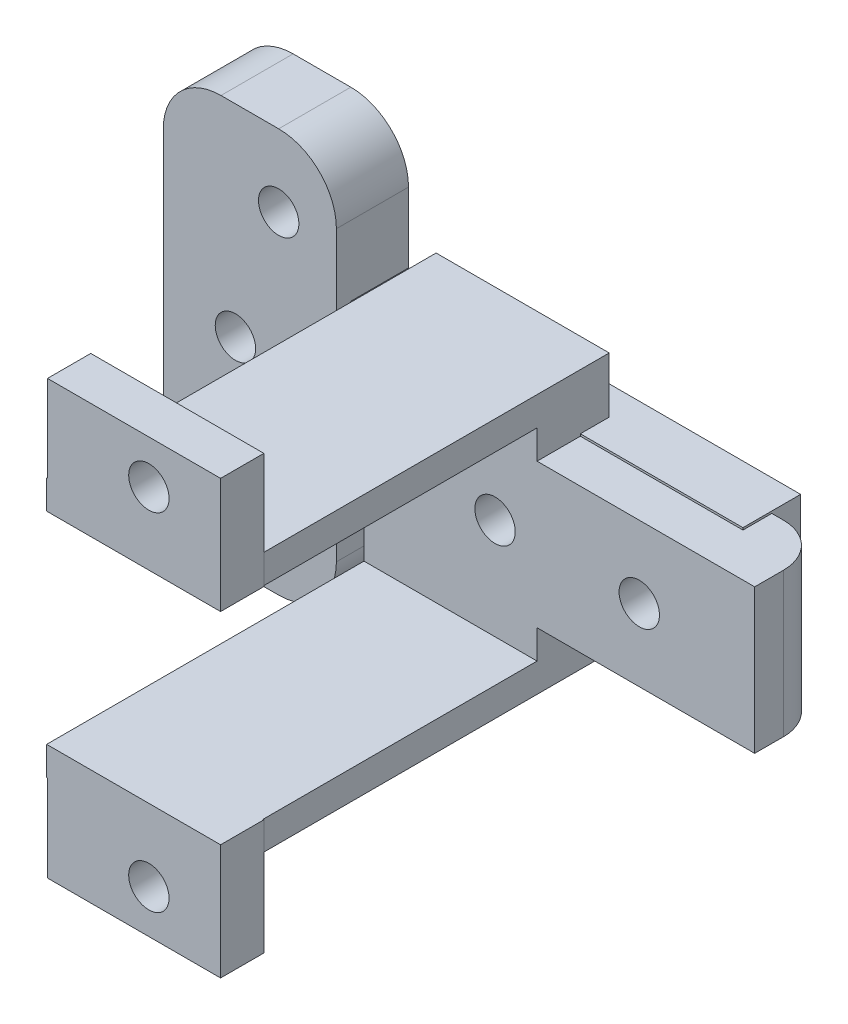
ISO-10303-21;
HEADER;
FILE_DESCRIPTION(('STEP AP214'),'2;1');
FILE_NAME('part.step','',(''),(''),'','','');
FILE_SCHEMA(('AUTOMOTIVE_DESIGN { 1 0 10303 214 1 1 1 1 }'));
ENDSEC;
DATA;
#1=APPLICATION_CONTEXT('core data for automotive mechanical design processes');
#2=APPLICATION_PROTOCOL_DEFINITION('international standard','automotive_design',2000,#1);
#3=PRODUCT_CONTEXT('',#1,'mechanical');
#4=PRODUCT('Part','Part','',(#3));
#5=PRODUCT_RELATED_PRODUCT_CATEGORY('part','',(#4));
#6=PRODUCT_DEFINITION_FORMATION('','',#4);
#7=PRODUCT_DEFINITION_CONTEXT('part definition',#1,'design');
#8=PRODUCT_DEFINITION('design','',#6,#7);
#9=PRODUCT_DEFINITION_SHAPE('','',#8);
#10=(LENGTH_UNIT() NAMED_UNIT(*) SI_UNIT(.MILLI.,.METRE.));
#11=(NAMED_UNIT(*) PLANE_ANGLE_UNIT() SI_UNIT($,.RADIAN.));
#12=(NAMED_UNIT(*) SI_UNIT($,.STERADIAN.) SOLID_ANGLE_UNIT());
#13=UNCERTAINTY_MEASURE_WITH_UNIT(LENGTH_MEASURE(1.E-05),#10,'distance_accuracy_value','');
#14=(GEOMETRIC_REPRESENTATION_CONTEXT(3) GLOBAL_UNCERTAINTY_ASSIGNED_CONTEXT((#13)) GLOBAL_UNIT_ASSIGNED_CONTEXT((#10,
#11,#12)) REPRESENTATION_CONTEXT('',''));
#15=CARTESIAN_POINT('',(0.,0.,0.));
#16=DIRECTION('',(0.,0.,1.));
#17=DIRECTION('',(1.,0.,0.));
#18=AXIS2_PLACEMENT_3D('',#15,#16,#17);
#19=CARTESIAN_POINT('',(15.9139926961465,-4.,23.25));
#20=DIRECTION('',(-1.,0.,0.));
#21=DIRECTION('',(0.,0.,1.));
#22=AXIS2_PLACEMENT_3D('',#19,#20,#21);
#23=PLANE('',#22);
#24=DIRECTION('',(0.,-1.,0.));
#25=VECTOR('',#24,1.);
#26=CARTESIAN_POINT('',(15.9139926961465,-4.,1.25));
#27=LINE('',#26,#25);
#28=CARTESIAN_POINT('',(15.9139926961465,3.93952022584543,1.25));
#29=VERTEX_POINT('',#28);
#30=CARTESIAN_POINT('',(15.9139926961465,-2.,1.25));
#31=VERTEX_POINT('',#30);
#32=EDGE_CURVE('E315',#29,#31,#27,.T.);
#33=ORIENTED_EDGE('',*,*,#32,.F.);
#34=DIRECTION('',(0.,0.,1.));
#35=VECTOR('',#34,1.);
#36=CARTESIAN_POINT('',(15.9139926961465,3.93952022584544,-12.75));
#37=LINE('',#36,#35);
#38=CARTESIAN_POINT('',(15.9139926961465,3.93952022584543,-1.75000000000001));
#39=VERTEX_POINT('',#38);
#40=EDGE_CURVE('E291',#29,#39,#37,.F.);
#41=ORIENTED_EDGE('',*,*,#40,.T.);
#42=DIRECTION('',(0.,1.,0.));
#43=VECTOR('',#42,1.);
#44=CARTESIAN_POINT('',(15.9139926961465,10.,-1.75000000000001));
#45=LINE('',#44,#43);
#46=CARTESIAN_POINT('',(15.9139926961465,0.,-1.75000000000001));
#47=VERTEX_POINT('',#46);
#48=EDGE_CURVE('E551',#47,#39,#45,.T.);
#49=ORIENTED_EDGE('',*,*,#48,.F.);
#50=DIRECTION('',(0.,0.,1.));
#51=VECTOR('',#50,1.);
#52=CARTESIAN_POINT('',(15.9139926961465,0.,0.));
#53=LINE('',#52,#51);
#54=CARTESIAN_POINT('',(15.9139926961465,0.,-3.75));
#55=VERTEX_POINT('',#54);
#56=EDGE_CURVE('E576',#55,#47,#53,.T.);
#57=ORIENTED_EDGE('',*,*,#56,.F.);
#58=DIRECTION('',(0.,1.,0.));
#59=VECTOR('',#58,1.);
#60=CARTESIAN_POINT('',(15.9139926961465,-4.,-3.75));
#61=LINE('',#60,#59);
#62=CARTESIAN_POINT('',(15.9139926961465,-4.,-3.75));
#63=VERTEX_POINT('',#62);
#64=EDGE_CURVE('E539',#63,#55,#61,.T.);
#65=ORIENTED_EDGE('',*,*,#64,.F.);
#66=DIRECTION('',(0.,0.,-1.));
#67=VECTOR('',#66,1.);
#68=CARTESIAN_POINT('',(15.9139926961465,-4.,23.25));
#69=LINE('',#68,#67);
#70=CARTESIAN_POINT('',(15.9139926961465,-4.,23.25));
#71=VERTEX_POINT('',#70);
#72=EDGE_CURVE('E548',#71,#63,#69,.T.);
#73=ORIENTED_EDGE('',*,*,#72,.F.);
#74=DIRECTION('',(0.,1.,0.));
#75=VECTOR('',#74,1.);
#76=CARTESIAN_POINT('',(15.9139926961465,-4.,23.25));
#77=LINE('',#76,#75);
#78=CARTESIAN_POINT('',(15.9139926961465,-2.,23.25));
#79=VERTEX_POINT('',#78);
#80=EDGE_CURVE('E525',#71,#79,#77,.T.);
#81=ORIENTED_EDGE('',*,*,#80,.T.);
#82=DIRECTION('',(0.,0.,-1.));
#83=VECTOR('',#82,1.);
#84=CARTESIAN_POINT('',(15.9139926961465,-2.,23.25));
#85=LINE('',#84,#83);
#86=EDGE_CURVE('E513',#79,#31,#85,.T.);
#87=ORIENTED_EDGE('',*,*,#86,.T.);
#88=EDGE_LOOP('',(#33,#41,#49,#57,#65,#73,#81,#87));
#89=FACE_BOUND('',#88,.T.);
#90=ADVANCED_FACE('F33',(#89),#23,.T.);
#91=CARTESIAN_POINT('',(15.9139926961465,6.06047977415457,-1.75000000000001));
#92=VERTEX_POINT('',#91);
#93=CARTESIAN_POINT('',(15.9139926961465,10.1457568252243,-1.75));
#94=VERTEX_POINT('',#93);
#95=EDGE_CURVE('E305',#92,#94,#45,.T.);
#96=ORIENTED_EDGE('',*,*,#95,.F.);
#97=DIRECTION('',(0.,0.,1.));
#98=VECTOR('',#97,1.);
#99=CARTESIAN_POINT('',(15.9139926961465,6.06047977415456,-12.75));
#100=LINE('',#99,#98);
#101=CARTESIAN_POINT('',(15.9139926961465,6.06047977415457,1.25));
#102=VERTEX_POINT('',#101);
#103=EDGE_CURVE('E288',#92,#102,#100,.T.);
#104=ORIENTED_EDGE('',*,*,#103,.T.);
#105=CARTESIAN_POINT('',(15.9139926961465,12.,1.25));
#106=VERTEX_POINT('',#105);
#107=EDGE_CURVE('E303',#106,#102,#27,.T.);
#108=ORIENTED_EDGE('',*,*,#107,.F.);
#109=DIRECTION('',(0.,0.,1.));
#110=VECTOR('',#109,1.);
#111=CARTESIAN_POINT('',(15.9139926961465,12.,23.25));
#112=LINE('',#111,#110);
#113=CARTESIAN_POINT('',(15.9139926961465,12.,23.25));
#114=VERTEX_POINT('',#113);
#115=EDGE_CURVE('E509',#106,#114,#112,.T.);
#116=ORIENTED_EDGE('',*,*,#115,.T.);
#117=CARTESIAN_POINT('',(15.9139926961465,14.,23.25));
#118=VERTEX_POINT('',#117);
#119=EDGE_CURVE('E523',#114,#118,#77,.T.);
#120=ORIENTED_EDGE('',*,*,#119,.T.);
#121=DIRECTION('',(0.,0.,-1.));
#122=VECTOR('',#121,1.);
#123=CARTESIAN_POINT('',(15.9139926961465,14.,23.25));
#124=LINE('',#123,#122);
#125=CARTESIAN_POINT('',(15.9139926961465,14.,-3.75));
#126=VERTEX_POINT('',#125);
#127=EDGE_CURVE('E545',#118,#126,#124,.T.);
#128=ORIENTED_EDGE('',*,*,#127,.T.);
#129=CARTESIAN_POINT('',(15.9139926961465,10.1457568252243,-3.75));
#130=VERTEX_POINT('',#129);
#131=EDGE_CURVE('E538',#130,#126,#61,.T.);
#132=ORIENTED_EDGE('',*,*,#131,.F.);
#133=DIRECTION('',(0.,0.,-1.));
#134=VECTOR('',#133,1.);
#135=CARTESIAN_POINT('',(15.9139926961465,10.1457568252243,23.25));
#136=LINE('',#135,#134);
#137=EDGE_CURVE('E633',#94,#130,#136,.T.);
#138=ORIENTED_EDGE('',*,*,#137,.F.);
#139=EDGE_LOOP('',(#96,#104,#108,#116,#120,#128,#132,#138));
#140=FACE_BOUND('',#139,.T.);
#141=ADVANCED_FACE('F301',(#140),#23,.T.);
#142=CARTESIAN_POINT('',(40.,10.,-0.750000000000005));
#143=DIRECTION('',(0.,-1.,0.));
#144=DIRECTION('',(0.,0.,-1.));
#145=AXIS2_PLACEMENT_3D('',#142,#143,#144);
#146=CYLINDRICAL_SURFACE('',#145,3.);
#147=DIRECTION('',(0.,-1.,0.));
#148=VECTOR('',#147,1.);
#149=CARTESIAN_POINT('',(40.,10.,-3.75));
#150=LINE('',#149,#148);
#151=CARTESIAN_POINT('',(40.,10.,-3.75));
#152=VERTEX_POINT('',#151);
#153=CARTESIAN_POINT('',(40.,0.,-3.75));
#154=VERTEX_POINT('',#153);
#155=EDGE_CURVE('E326',#152,#154,#150,.T.);
#156=ORIENTED_EDGE('',*,*,#155,.F.);
#157=CARTESIAN_POINT('',(40.,10.,-0.750000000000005));
#158=DIRECTION('',(0.,1.,0.));
#159=DIRECTION('',(0.,0.,1.));
#160=AXIS2_PLACEMENT_3D('',#157,#158,#159);
#161=CIRCLE('',#160,3.);
#162=CARTESIAN_POINT('',(43.,10.,-0.750000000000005));
#163=VERTEX_POINT('',#162);
#164=EDGE_CURVE('E332',#163,#152,#161,.T.);
#165=ORIENTED_EDGE('',*,*,#164,.F.);
#166=DIRECTION('',(0.,-1.,0.));
#167=VECTOR('',#166,1.);
#168=CARTESIAN_POINT('',(43.,10.,-0.750000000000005));
#169=LINE('',#168,#167);
#170=CARTESIAN_POINT('',(43.,0.,-0.750000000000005));
#171=VERTEX_POINT('',#170);
#172=EDGE_CURVE('E329',#171,#163,#169,.F.);
#173=ORIENTED_EDGE('',*,*,#172,.F.);
#174=CARTESIAN_POINT('',(40.,0.,-0.750000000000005));
#175=DIRECTION('',(0.,1.,0.));
#176=DIRECTION('',(0.,0.,1.));
#177=AXIS2_PLACEMENT_3D('',#174,#175,#176);
#178=CIRCLE('',#177,3.);
#179=EDGE_CURVE('E334',#154,#171,#178,.F.);
#180=ORIENTED_EDGE('',*,*,#179,.F.);
#181=EDGE_LOOP('',(#156,#165,#173,#180));
#182=FACE_BOUND('',#181,.T.);
#183=ADVANCED_FACE('F764',(#182),#146,.T.);
#184=CARTESIAN_POINT('',(43.,10.,-3.75));
#185=DIRECTION('',(0.,0.,1.));
#186=DIRECTION('',(1.,0.,0.));
#187=AXIS2_PLACEMENT_3D('',#184,#185,#186);
#188=PLANE('',#187);
#189=DIRECTION('',(-1.,0.,0.));
#190=VECTOR('',#189,1.);
#191=CARTESIAN_POINT('',(43.,10.,-3.75));
#192=LINE('',#191,#190);
#193=CARTESIAN_POINT('',(39.1865840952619,10.,-3.75));
#194=VERTEX_POINT('',#193);
#195=EDGE_CURVE('E564',#152,#194,#192,.T.);
#196=ORIENTED_EDGE('',*,*,#195,.F.);
#197=ORIENTED_EDGE('',*,*,#155,.T.);
#198=DIRECTION('',(-1.,0.,0.));
#199=VECTOR('',#198,1.);
#200=CARTESIAN_POINT('',(43.,0.,-3.75));
#201=LINE('',#200,#199);
#202=CARTESIAN_POINT('',(39.1865840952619,0.,-3.75));
#203=VERTEX_POINT('',#202);
#204=EDGE_CURVE('E561',#154,#203,#201,.T.);
#205=ORIENTED_EDGE('',*,*,#204,.T.);
#206=DIRECTION('',(0.,1.,0.));
#207=VECTOR('',#206,1.);
#208=CARTESIAN_POINT('',(39.1865840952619,10.,-3.75));
#209=LINE('',#208,#207);
#210=EDGE_CURVE('E318',#203,#194,#209,.T.);
#211=ORIENTED_EDGE('',*,*,#210,.T.);
#212=EDGE_LOOP('',(#196,#197,#205,#211));
#213=FACE_BOUND('',#212,.T.);
#214=ADVANCED_FACE('F781',(#213),#188,.F.);
#215=DIRECTION('',(0.,-1.,0.));
#216=VECTOR('',#215,1.);
#217=CARTESIAN_POINT('',(27.9139926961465,-4.,-3.75));
#218=LINE('',#217,#216);
#219=CARTESIAN_POINT('',(27.9139926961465,14.,-3.75));
#220=VERTEX_POINT('',#219);
#221=CARTESIAN_POINT('',(27.9139926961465,10.1457568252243,-3.75));
#222=VERTEX_POINT('',#221);
#223=EDGE_CURVE('E531',#220,#222,#218,.T.);
#224=ORIENTED_EDGE('',*,*,#223,.T.);
#225=DIRECTION('',(-1.,0.,0.));
#226=VECTOR('',#225,1.);
#227=CARTESIAN_POINT('',(43.,10.1457568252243,-3.75));
#228=LINE('',#227,#226);
#229=EDGE_CURVE('E630',#222,#130,#228,.T.);
#230=ORIENTED_EDGE('',*,*,#229,.T.);
#231=ORIENTED_EDGE('',*,*,#131,.T.);
#232=DIRECTION('',(1.,0.,0.));
#233=VECTOR('',#232,1.);
#234=CARTESIAN_POINT('',(27.9139926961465,14.,-3.75));
#235=LINE('',#234,#233);
#236=EDGE_CURVE('E524',#126,#220,#235,.T.);
#237=ORIENTED_EDGE('',*,*,#236,.T.);
#238=EDGE_LOOP('',(#224,#230,#231,#237));
#239=FACE_BOUND('',#238,.T.);
#240=ADVANCED_FACE('F773',(#239),#188,.F.);
#241=CARTESIAN_POINT('',(27.9139926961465,-4.,23.25));
#242=DIRECTION('',(1.,0.,0.));
#243=DIRECTION('',(0.,0.,-1.));
#244=AXIS2_PLACEMENT_3D('',#241,#242,#243);
#245=PLANE('',#244);
#246=DIRECTION('',(0.,0.,1.));
#247=VECTOR('',#246,1.);
#248=CARTESIAN_POINT('',(27.9139926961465,-2.,23.25));
#249=LINE('',#248,#247);
#250=CARTESIAN_POINT('',(27.9139926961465,-2.,1.25));
#251=VERTEX_POINT('',#250);
#252=CARTESIAN_POINT('',(27.9139926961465,-2.,20.25));
#253=VERTEX_POINT('',#252);
#254=EDGE_CURVE('E516',#251,#253,#249,.T.);
#255=ORIENTED_EDGE('',*,*,#254,.T.);
#256=DIRECTION('',(0.,-1.,0.));
#257=VECTOR('',#256,1.);
#258=CARTESIAN_POINT('',(27.9139926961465,-4.,20.25));
#259=LINE('',#258,#257);
#260=CARTESIAN_POINT('',(27.9139926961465,-4.,20.25));
#261=VERTEX_POINT('',#260);
#262=EDGE_CURVE('E466',#253,#261,#259,.T.);
#263=ORIENTED_EDGE('',*,*,#262,.T.);
#264=DIRECTION('',(0.,0.,-1.));
#265=VECTOR('',#264,1.);
#266=CARTESIAN_POINT('',(27.9139926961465,-4.,23.25));
#267=LINE('',#266,#265);
#268=CARTESIAN_POINT('',(27.9139926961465,-4.,-3.75));
#269=VERTEX_POINT('',#268);
#270=EDGE_CURVE('E530',#261,#269,#267,.T.);
#271=ORIENTED_EDGE('',*,*,#270,.T.);
#272=CARTESIAN_POINT('',(27.9139926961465,0.,-3.75));
#273=VERTEX_POINT('',#272);
#274=EDGE_CURVE('E535',#273,#269,#218,.T.);
#275=ORIENTED_EDGE('',*,*,#274,.F.);
#276=DIRECTION('',(0.,0.,-1.));
#277=VECTOR('',#276,1.);
#278=CARTESIAN_POINT('',(27.9139926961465,0.,0.));
#279=LINE('',#278,#277);
#280=CARTESIAN_POINT('',(27.9139926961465,0.,1.25));
#281=VERTEX_POINT('',#280);
#282=EDGE_CURVE('E579',#281,#273,#279,.T.);
#283=ORIENTED_EDGE('',*,*,#282,.F.);
#284=DIRECTION('',(0.,1.,0.));
#285=VECTOR('',#284,1.);
#286=CARTESIAN_POINT('',(27.9139926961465,-4.,1.25));
#287=LINE('',#286,#285);
#288=EDGE_CURVE('E520',#251,#281,#287,.T.);
#289=ORIENTED_EDGE('',*,*,#288,.F.);
#290=EDGE_LOOP('',(#255,#263,#271,#275,#283,#289));
#291=FACE_BOUND('',#290,.T.);
#292=ADVANCED_FACE('F618',(#291),#245,.T.);
#293=CARTESIAN_POINT('',(27.9139926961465,-4.,23.25));
#294=DIRECTION('',(0.,-1.,0.));
#295=DIRECTION('',(0.,0.,-1.));
#296=AXIS2_PLACEMENT_3D('',#293,#294,#295);
#297=PLANE('',#296);
#298=DIRECTION('',(-1.,0.,0.));
#299=VECTOR('',#298,1.);
#300=CARTESIAN_POINT('',(27.9139926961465,-4.,20.25));
#301=LINE('',#300,#299);
#302=CARTESIAN_POINT('',(15.9720386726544,-4.,20.25));
#303=VERTEX_POINT('',#302);
#304=EDGE_CURVE('E459',#261,#303,#301,.T.);
#305=ORIENTED_EDGE('',*,*,#304,.T.);
#306=DIRECTION('',(0.,0.,1.));
#307=VECTOR('',#306,1.);
#308=CARTESIAN_POINT('',(15.9720386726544,-4.,23.25));
#309=LINE('',#308,#307);
#310=CARTESIAN_POINT('',(15.9720386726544,-4.,23.25));
#311=VERTEX_POINT('',#310);
#312=EDGE_CURVE('E468',#303,#311,#309,.T.);
#313=ORIENTED_EDGE('',*,*,#312,.T.);
#314=DIRECTION('',(-1.,0.,0.));
#315=VECTOR('',#314,1.);
#316=CARTESIAN_POINT('',(27.9139926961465,-4.,23.25));
#317=LINE('',#316,#315);
#318=EDGE_CURVE('E521',#311,#71,#317,.T.);
#319=ORIENTED_EDGE('',*,*,#318,.T.);
#320=ORIENTED_EDGE('',*,*,#72,.T.);
#321=DIRECTION('',(-1.,0.,0.));
#322=VECTOR('',#321,1.);
#323=CARTESIAN_POINT('',(27.9139926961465,-4.,-3.75));
#324=LINE('',#323,#322);
#325=EDGE_CURVE('E534',#269,#63,#324,.T.);
#326=ORIENTED_EDGE('',*,*,#325,.F.);
#327=ORIENTED_EDGE('',*,*,#270,.F.);
#328=EDGE_LOOP('',(#305,#313,#319,#320,#326,#327));
#329=FACE_BOUND('',#328,.T.);
#330=ADVANCED_FACE('F598',(#329),#297,.T.);
#331=DIRECTION('',(0.,0.,1.));
#332=VECTOR('',#331,1.);
#333=CARTESIAN_POINT('',(27.9139926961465,10.1457568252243,23.25));
#334=LINE('',#333,#332);
#335=CARTESIAN_POINT('',(27.9139926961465,10.1457568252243,-1.75));
#336=VERTEX_POINT('',#335);
#337=EDGE_CURVE('E641',#222,#336,#334,.T.);
#338=ORIENTED_EDGE('',*,*,#337,.F.);
#339=ORIENTED_EDGE('',*,*,#223,.F.);
#340=DIRECTION('',(0.,0.,-1.));
#341=VECTOR('',#340,1.);
#342=CARTESIAN_POINT('',(27.9139926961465,14.,23.25));
#343=LINE('',#342,#341);
#344=CARTESIAN_POINT('',(27.9139926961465,14.,20.25));
#345=VERTEX_POINT('',#344);
#346=EDGE_CURVE('E543',#345,#220,#343,.T.);
#347=ORIENTED_EDGE('',*,*,#346,.F.);
#348=DIRECTION('',(0.,-1.,0.));
#349=VECTOR('',#348,1.);
#350=CARTESIAN_POINT('',(27.9139926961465,-4.,20.25));
#351=LINE('',#350,#349);
#352=CARTESIAN_POINT('',(27.9139926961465,12.,20.25));
#353=VERTEX_POINT('',#352);
#354=EDGE_CURVE('E500',#345,#353,#351,.T.);
#355=ORIENTED_EDGE('',*,*,#354,.T.);
#356=DIRECTION('',(0.,0.,-1.));
#357=VECTOR('',#356,1.);
#358=CARTESIAN_POINT('',(27.9139926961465,12.,23.25));
#359=LINE('',#358,#357);
#360=CARTESIAN_POINT('',(27.9139926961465,12.,1.25));
#361=VERTEX_POINT('',#360);
#362=EDGE_CURVE('E511',#353,#361,#359,.T.);
#363=ORIENTED_EDGE('',*,*,#362,.T.);
#364=CARTESIAN_POINT('',(27.9139926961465,10.,1.25));
#365=VERTEX_POINT('',#364);
#366=EDGE_CURVE('E518',#365,#361,#287,.T.);
#367=ORIENTED_EDGE('',*,*,#366,.F.);
#368=DIRECTION('',(0.,0.,-1.));
#369=VECTOR('',#368,1.);
#370=CARTESIAN_POINT('',(27.9139926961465,10.,0.));
#371=LINE('',#370,#369);
#372=CARTESIAN_POINT('',(27.9139926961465,10.,-1.75));
#373=VERTEX_POINT('',#372);
#374=EDGE_CURVE('E554',#365,#373,#371,.T.);
#375=ORIENTED_EDGE('',*,*,#374,.T.);
#376=DIRECTION('',(0.,1.,0.));
#377=VECTOR('',#376,1.);
#378=CARTESIAN_POINT('',(27.9139926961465,-4.,-1.75));
#379=LINE('',#378,#377);
#380=EDGE_CURVE('E631',#373,#336,#379,.T.);
#381=ORIENTED_EDGE('',*,*,#380,.T.);
#382=EDGE_LOOP('',(#338,#339,#347,#355,#363,#367,#375,#381));
#383=FACE_BOUND('',#382,.T.);
#384=ADVANCED_FACE('F701',(#383),#245,.T.);
#385=CARTESIAN_POINT('',(0.,0.,23.25));
#386=DIRECTION('',(0.,0.,1.));
#387=DIRECTION('',(1.,0.,0.));
#388=AXIS2_PLACEMENT_3D('',#385,#386,#387);
#389=PLANE('',#388);
#390=CARTESIAN_POINT('',(23.,-7.,23.25));
#391=DIRECTION('',(0.,0.,1.));
#392=DIRECTION('',(-1.,0.,0.));
#393=AXIS2_PLACEMENT_3D('',#390,#391,#392);
#394=CIRCLE('',#393,1.4);
#395=CARTESIAN_POINT('',(21.6,-7.,23.25));
#396=VERTEX_POINT('',#395);
#397=EDGE_CURVE('E426',#396,#396,#394,.T.);
#398=ORIENTED_EDGE('',*,*,#397,.F.);
#399=EDGE_LOOP('',(#398));
#400=FACE_BOUND('',#399,.T.);
#401=DIRECTION('',(-1.,0.,0.));
#402=VECTOR('',#401,1.);
#403=CARTESIAN_POINT('',(0.,-2.,23.25));
#404=LINE('',#403,#402);
#405=CARTESIAN_POINT('',(27.9720386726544,-2.,23.25));
#406=VERTEX_POINT('',#405);
#407=EDGE_CURVE('E320',#406,#79,#404,.T.);
#408=ORIENTED_EDGE('',*,*,#407,.T.);
#409=ORIENTED_EDGE('',*,*,#80,.F.);
#410=ORIENTED_EDGE('',*,*,#318,.F.);
#411=DIRECTION('',(0.,1.,0.));
#412=VECTOR('',#411,1.);
#413=CARTESIAN_POINT('',(15.9720386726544,-1.99999999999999,23.25));
#414=LINE('',#413,#412);
#415=CARTESIAN_POINT('',(15.9720386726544,-10.,23.25));
#416=VERTEX_POINT('',#415);
#417=EDGE_CURVE('E452',#416,#311,#414,.T.);
#418=ORIENTED_EDGE('',*,*,#417,.F.);
#419=DIRECTION('',(-1.,0.,0.));
#420=VECTOR('',#419,1.);
#421=CARTESIAN_POINT('',(27.9720386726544,-10.,23.25));
#422=LINE('',#421,#420);
#423=CARTESIAN_POINT('',(27.9720386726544,-10.,23.25));
#424=VERTEX_POINT('',#423);
#425=EDGE_CURVE('E442',#424,#416,#422,.T.);
#426=ORIENTED_EDGE('',*,*,#425,.F.);
#427=DIRECTION('',(0.,-1.,0.));
#428=VECTOR('',#427,1.);
#429=CARTESIAN_POINT('',(27.9720386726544,-2.,23.25));
#430=LINE('',#429,#428);
#431=EDGE_CURVE('E435',#406,#424,#430,.T.);
#432=ORIENTED_EDGE('',*,*,#431,.F.);
#433=EDGE_LOOP('',(#408,#409,#410,#418,#426,#432));
#434=FACE_BOUND('',#433,.T.);
#435=ADVANCED_FACE('F587',(#400,#434),#389,.T.);
#436=CARTESIAN_POINT('',(23.,17.,23.25));
#437=DIRECTION('',(0.,0.,-1.));
#438=DIRECTION('',(-1.,0.,0.));
#439=AXIS2_PLACEMENT_3D('',#436,#437,#438);
#440=CIRCLE('',#439,1.4);
#441=CARTESIAN_POINT('',(21.6,17.,23.25));
#442=VERTEX_POINT('',#441);
#443=EDGE_CURVE('E432',#442,#442,#440,.T.);
#444=ORIENTED_EDGE('',*,*,#443,.T.);
#445=EDGE_LOOP('',(#444));
#446=FACE_BOUND('',#445,.T.);
#447=DIRECTION('',(1.,0.,0.));
#448=VECTOR('',#447,1.);
#449=CARTESIAN_POINT('',(0.,12.,23.25));
#450=LINE('',#449,#448);
#451=CARTESIAN_POINT('',(27.9720386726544,12.,23.25));
#452=VERTEX_POINT('',#451);
#453=EDGE_CURVE('E580',#114,#452,#450,.T.);
#454=ORIENTED_EDGE('',*,*,#453,.T.);
#455=DIRECTION('',(0.,1.,0.));
#456=VECTOR('',#455,1.);
#457=CARTESIAN_POINT('',(27.9720386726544,12.,23.25));
#458=LINE('',#457,#456);
#459=CARTESIAN_POINT('',(27.9720386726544,20.,23.25));
#460=VERTEX_POINT('',#459);
#461=EDGE_CURVE('E471',#452,#460,#458,.T.);
#462=ORIENTED_EDGE('',*,*,#461,.T.);
#463=DIRECTION('',(-1.,0.,0.));
#464=VECTOR('',#463,1.);
#465=CARTESIAN_POINT('',(27.9720386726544,20.,23.25));
#466=LINE('',#465,#464);
#467=CARTESIAN_POINT('',(15.9720386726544,20.,23.25));
#468=VERTEX_POINT('',#467);
#469=EDGE_CURVE('E487',#460,#468,#466,.T.);
#470=ORIENTED_EDGE('',*,*,#469,.T.);
#471=DIRECTION('',(0.,-1.,0.));
#472=VECTOR('',#471,1.);
#473=CARTESIAN_POINT('',(15.9720386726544,12.,23.25));
#474=LINE('',#473,#472);
#475=CARTESIAN_POINT('',(15.9720386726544,14.,23.25));
#476=VERTEX_POINT('',#475);
#477=EDGE_CURVE('E476',#468,#476,#474,.T.);
#478=ORIENTED_EDGE('',*,*,#477,.T.);
#479=DIRECTION('',(1.,0.,0.));
#480=VECTOR('',#479,1.);
#481=CARTESIAN_POINT('',(27.9139926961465,14.,23.25));
#482=LINE('',#481,#480);
#483=EDGE_CURVE('E528',#118,#476,#482,.T.);
#484=ORIENTED_EDGE('',*,*,#483,.F.);
#485=ORIENTED_EDGE('',*,*,#119,.F.);
#486=EDGE_LOOP('',(#454,#462,#470,#478,#484,#485));
#487=FACE_BOUND('',#486,.T.);
#488=ADVANCED_FACE('F776',(#446,#487),#389,.T.);
#489=CARTESIAN_POINT('',(0.,10.,0.));
#490=DIRECTION('',(0.,1.,0.));
#491=DIRECTION('',(0.,0.,1.));
#492=AXIS2_PLACEMENT_3D('',#489,#490,#491);
#493=PLANE('',#492);
#494=DIRECTION('',(0.,0.,-1.));
#495=VECTOR('',#494,1.);
#496=CARTESIAN_POINT('',(43.,10.,1.25));
#497=LINE('',#496,#495);
#498=CARTESIAN_POINT('',(43.,10.,1.25));
#499=VERTEX_POINT('',#498);
#500=EDGE_CURVE('E560',#499,#163,#497,.T.);
#501=ORIENTED_EDGE('',*,*,#500,.T.);
#502=ORIENTED_EDGE('',*,*,#164,.T.);
#503=ORIENTED_EDGE('',*,*,#195,.T.);
#504=DIRECTION('',(0.,0.,-1.));
#505=VECTOR('',#504,1.);
#506=CARTESIAN_POINT('',(39.1865840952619,10.,0.));
#507=LINE('',#506,#505);
#508=CARTESIAN_POINT('',(39.1865840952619,10.,-1.75));
#509=VERTEX_POINT('',#508);
#510=EDGE_CURVE('E644',#509,#194,#507,.T.);
#511=ORIENTED_EDGE('',*,*,#510,.F.);
#512=DIRECTION('',(-1.,0.,0.));
#513=VECTOR('',#512,1.);
#514=CARTESIAN_POINT('',(0.,10.,-1.75));
#515=LINE('',#514,#513);
#516=EDGE_CURVE('E635',#509,#373,#515,.T.);
#517=ORIENTED_EDGE('',*,*,#516,.T.);
#518=ORIENTED_EDGE('',*,*,#374,.F.);
#519=DIRECTION('',(1.,0.,0.));
#520=VECTOR('',#519,1.);
#521=CARTESIAN_POINT('',(18.,10.,1.25));
#522=LINE('',#521,#520);
#523=EDGE_CURVE('E558',#365,#499,#522,.T.);
#524=ORIENTED_EDGE('',*,*,#523,.T.);
#525=EDGE_LOOP('',(#501,#502,#503,#511,#517,#518,#524));
#526=FACE_BOUND('',#525,.T.);
#527=ADVANCED_FACE('F695',(#526),#493,.T.);
#528=CARTESIAN_POINT('',(18.,10.,-1.75000000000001));
#529=DIRECTION('',(0.,0.,-1.));
#530=DIRECTION('',(-1.,0.,0.));
#531=AXIS2_PLACEMENT_3D('',#528,#529,#530);
#532=PLANE('',#531);
#533=CARTESIAN_POINT('',(15.,5.,-1.75000000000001));
#534=DIRECTION('',(0.,0.,-1.));
#535=DIRECTION('',(-1.,0.,0.));
#536=AXIS2_PLACEMENT_3D('',#533,#534,#535);
#537=CIRCLE('',#536,1.4);
#538=EDGE_CURVE('E306',#92,#39,#537,.F.);
#539=ORIENTED_EDGE('',*,*,#538,.F.);
#540=ORIENTED_EDGE('',*,*,#95,.T.);
#541=DIRECTION('',(1.,0.,0.));
#542=VECTOR('',#541,1.);
#543=CARTESIAN_POINT('',(39.1865840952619,10.1457568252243,-1.75));
#544=LINE('',#543,#542);
#545=CARTESIAN_POINT('',(12.,10.1457568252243,-1.75));
#546=VERTEX_POINT('',#545);
#547=EDGE_CURVE('E689',#546,#94,#544,.T.);
#548=ORIENTED_EDGE('',*,*,#547,.F.);
#549=DIRECTION('',(0.,-1.,0.));
#550=VECTOR('',#549,1.);
#551=CARTESIAN_POINT('',(12.,10.,-1.75000000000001));
#552=LINE('',#551,#550);
#553=CARTESIAN_POINT('',(12.,0.,-1.75000000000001));
#554=VERTEX_POINT('',#553);
#555=EDGE_CURVE('E422',#546,#554,#552,.T.);
#556=ORIENTED_EDGE('',*,*,#555,.T.);
#557=DIRECTION('',(1.,0.,0.));
#558=VECTOR('',#557,1.);
#559=CARTESIAN_POINT('',(18.,0.,-1.75000000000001));
#560=LINE('',#559,#558);
#561=EDGE_CURVE('E557',#554,#47,#560,.T.);
#562=ORIENTED_EDGE('',*,*,#561,.T.);
#563=ORIENTED_EDGE('',*,*,#48,.T.);
#564=EDGE_LOOP('',(#539,#540,#548,#556,#562,#563));
#565=FACE_BOUND('',#564,.T.);
#566=ADVANCED_FACE('F748',(#565),#532,.F.);
#567=CARTESIAN_POINT('',(18.,10.,1.25));
#568=DIRECTION('',(0.,0.,-1.));
#569=DIRECTION('',(-1.,0.,0.));
#570=AXIS2_PLACEMENT_3D('',#567,#568,#569);
#571=PLANE('',#570);
#572=CARTESIAN_POINT('',(25.,5.,1.25));
#573=DIRECTION('',(0.,0.,-1.));
#574=DIRECTION('',(-1.,0.,0.));
#575=AXIS2_PLACEMENT_3D('',#572,#573,#574);
#576=CIRCLE('',#575,1.4);
#577=CARTESIAN_POINT('',(23.6,5.,1.25));
#578=VERTEX_POINT('',#577);
#579=EDGE_CURVE('E295',#578,#578,#576,.T.);
#580=ORIENTED_EDGE('',*,*,#579,.T.);
#581=EDGE_LOOP('',(#580));
#582=FACE_BOUND('',#581,.T.);
#583=CARTESIAN_POINT('',(15.,5.,1.25));
#584=DIRECTION('',(0.,0.,-1.));
#585=DIRECTION('',(-1.,0.,0.));
#586=AXIS2_PLACEMENT_3D('',#583,#584,#585);
#587=CIRCLE('',#586,1.4);
#588=EDGE_CURVE('E284',#102,#29,#587,.T.);
#589=ORIENTED_EDGE('',*,*,#588,.T.);
#590=ORIENTED_EDGE('',*,*,#32,.T.);
#591=DIRECTION('',(1.,0.,0.));
#592=VECTOR('',#591,1.);
#593=CARTESIAN_POINT('',(12.,-2.,1.25));
#594=LINE('',#593,#592);
#595=EDGE_CURVE('E505',#31,#251,#594,.T.);
#596=ORIENTED_EDGE('',*,*,#595,.T.);
#597=ORIENTED_EDGE('',*,*,#288,.T.);
#598=DIRECTION('',(1.,0.,0.));
#599=VECTOR('',#598,1.);
#600=CARTESIAN_POINT('',(18.,0.,1.25));
#601=LINE('',#600,#599);
#602=CARTESIAN_POINT('',(43.,0.,1.25));
#603=VERTEX_POINT('',#602);
#604=EDGE_CURVE('E568',#281,#603,#601,.T.);
#605=ORIENTED_EDGE('',*,*,#604,.T.);
#606=DIRECTION('',(0.,-1.,0.));
#607=VECTOR('',#606,1.);
#608=CARTESIAN_POINT('',(43.,10.,1.25));
#609=LINE('',#608,#607);
#610=EDGE_CURVE('E566',#499,#603,#609,.T.);
#611=ORIENTED_EDGE('',*,*,#610,.F.);
#612=ORIENTED_EDGE('',*,*,#523,.F.);
#613=ORIENTED_EDGE('',*,*,#366,.T.);
#614=DIRECTION('',(-1.,0.,0.));
#615=VECTOR('',#614,1.);
#616=CARTESIAN_POINT('',(12.,12.,1.25));
#617=LINE('',#616,#615);
#618=EDGE_CURVE('E313',#361,#106,#617,.T.);
#619=ORIENTED_EDGE('',*,*,#618,.T.);
#620=ORIENTED_EDGE('',*,*,#107,.T.);
#621=EDGE_LOOP('',(#589,#590,#596,#597,#605,#611,#612,#613,#619,#620));
#622=FACE_BOUND('',#621,.T.);
#623=CARTESIAN_POINT('',(35.,5.,1.25));
#624=DIRECTION('',(0.,0.,-1.));
#625=DIRECTION('',(-1.,0.,0.));
#626=AXIS2_PLACEMENT_3D('',#623,#624,#625);
#627=CIRCLE('',#626,1.4);
#628=CARTESIAN_POINT('',(33.6,5.,1.25));
#629=VERTEX_POINT('',#628);
#630=EDGE_CURVE('E341',#629,#629,#627,.T.);
#631=ORIENTED_EDGE('',*,*,#630,.T.);
#632=EDGE_LOOP('',(#631));
#633=FACE_BOUND('',#632,.T.);
#634=ADVANCED_FACE('F309',(#582,#622,#633),#571,.F.);
#635=CARTESIAN_POINT('',(43.,10.,1.25));
#636=DIRECTION('',(-1.,0.,0.));
#637=DIRECTION('',(0.,0.,1.));
#638=AXIS2_PLACEMENT_3D('',#635,#636,#637);
#639=PLANE('',#638);
#640=DIRECTION('',(0.,0.,-1.));
#641=VECTOR('',#640,1.);
#642=CARTESIAN_POINT('',(43.,0.,1.25));
#643=LINE('',#642,#641);
#644=EDGE_CURVE('E570',#603,#171,#643,.T.);
#645=ORIENTED_EDGE('',*,*,#644,.T.);
#646=ORIENTED_EDGE('',*,*,#172,.T.);
#647=ORIENTED_EDGE('',*,*,#500,.F.);
#648=ORIENTED_EDGE('',*,*,#610,.T.);
#649=EDGE_LOOP('',(#645,#646,#647,#648));
#650=FACE_BOUND('',#649,.T.);
#651=ADVANCED_FACE('F747',(#650),#639,.F.);
#652=ORIENTED_EDGE('',*,*,#64,.T.);
#653=DIRECTION('',(1.,0.,0.));
#654=VECTOR('',#653,1.);
#655=CARTESIAN_POINT('',(43.,0.,-3.75));
#656=LINE('',#655,#654);
#657=EDGE_CURVE('E628',#55,#273,#656,.T.);
#658=ORIENTED_EDGE('',*,*,#657,.T.);
#659=ORIENTED_EDGE('',*,*,#274,.T.);
#660=ORIENTED_EDGE('',*,*,#325,.T.);
#661=EDGE_LOOP('',(#652,#658,#659,#660));
#662=FACE_BOUND('',#661,.T.);
#663=ADVANCED_FACE('F626',(#662),#188,.F.);
#664=CARTESIAN_POINT('',(0.,0.,0.));
#665=DIRECTION('',(0.,1.,0.));
#666=DIRECTION('',(0.,0.,1.));
#667=AXIS2_PLACEMENT_3D('',#664,#665,#666);
#668=PLANE('',#667);
#669=ORIENTED_EDGE('',*,*,#204,.F.);
#670=ORIENTED_EDGE('',*,*,#179,.T.);
#671=ORIENTED_EDGE('',*,*,#644,.F.);
#672=ORIENTED_EDGE('',*,*,#604,.F.);
#673=ORIENTED_EDGE('',*,*,#282,.T.);
#674=ORIENTED_EDGE('',*,*,#657,.F.);
#675=ORIENTED_EDGE('',*,*,#56,.T.);
#676=ORIENTED_EDGE('',*,*,#561,.F.);
#677=DIRECTION('',(0.,0.,-1.));
#678=VECTOR('',#677,1.);
#679=CARTESIAN_POINT('',(12.,0.,0.));
#680=LINE('',#679,#678);
#681=CARTESIAN_POINT('',(12.,0.,-5.75000000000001));
#682=VERTEX_POINT('',#681);
#683=EDGE_CURVE('E314',#554,#682,#680,.T.);
#684=ORIENTED_EDGE('',*,*,#683,.T.);
#685=DIRECTION('',(-1.,0.,0.));
#686=VECTOR('',#685,1.);
#687=CARTESIAN_POINT('',(39.1865840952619,0.,-5.75000000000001));
#688=LINE('',#687,#686);
#689=CARTESIAN_POINT('',(39.1865840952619,0.,-5.75000000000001));
#690=VERTEX_POINT('',#689);
#691=EDGE_CURVE('E680',#690,#682,#688,.T.);
#692=ORIENTED_EDGE('',*,*,#691,.F.);
#693=DIRECTION('',(0.,0.,-1.));
#694=VECTOR('',#693,1.);
#695=CARTESIAN_POINT('',(39.1865840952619,0.,-1.75));
#696=LINE('',#695,#694);
#697=EDGE_CURVE('E674',#203,#690,#696,.T.);
#698=ORIENTED_EDGE('',*,*,#697,.F.);
#699=EDGE_LOOP('',(#669,#670,#671,#672,#673,#674,#675,#676,#684,#692,#698));
#700=FACE_BOUND('',#699,.T.);
#701=ADVANCED_FACE('F777',(#700),#668,.F.);
#702=CARTESIAN_POINT('',(27.9139926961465,14.,23.25));
#703=DIRECTION('',(0.,1.,0.));
#704=DIRECTION('',(0.,0.,1.));
#705=AXIS2_PLACEMENT_3D('',#702,#703,#704);
#706=PLANE('',#705);
#707=DIRECTION('',(0.,0.,1.));
#708=VECTOR('',#707,1.);
#709=CARTESIAN_POINT('',(15.9720386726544,14.,23.25));
#710=LINE('',#709,#708);
#711=CARTESIAN_POINT('',(15.9720386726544,14.,20.25));
#712=VERTEX_POINT('',#711);
#713=EDGE_CURVE('E502',#712,#476,#710,.T.);
#714=ORIENTED_EDGE('',*,*,#713,.F.);
#715=DIRECTION('',(1.,0.,0.));
#716=VECTOR('',#715,1.);
#717=CARTESIAN_POINT('',(27.9139926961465,14.,20.25));
#718=LINE('',#717,#716);
#719=EDGE_CURVE('E495',#712,#345,#718,.T.);
#720=ORIENTED_EDGE('',*,*,#719,.T.);
#721=ORIENTED_EDGE('',*,*,#346,.T.);
#722=ORIENTED_EDGE('',*,*,#236,.F.);
#723=ORIENTED_EDGE('',*,*,#127,.F.);
#724=ORIENTED_EDGE('',*,*,#483,.T.);
#725=EDGE_LOOP('',(#714,#720,#721,#722,#723,#724));
#726=FACE_BOUND('',#725,.T.);
#727=ADVANCED_FACE('F767',(#726),#706,.T.);
#728=CARTESIAN_POINT('',(12.,-2.,29.25));
#729=DIRECTION('',(0.,1.,0.));
#730=DIRECTION('',(0.,0.,1.));
#731=AXIS2_PLACEMENT_3D('',#728,#729,#730);
#732=PLANE('',#731);
#733=ORIENTED_EDGE('',*,*,#86,.F.);
#734=ORIENTED_EDGE('',*,*,#407,.F.);
#735=DIRECTION('',(0.,0.,1.));
#736=VECTOR('',#735,1.);
#737=CARTESIAN_POINT('',(27.9720386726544,-2.,20.25));
#738=LINE('',#737,#736);
#739=CARTESIAN_POINT('',(27.9720386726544,-2.,20.25));
#740=VERTEX_POINT('',#739);
#741=EDGE_CURVE('E449',#740,#406,#738,.T.);
#742=ORIENTED_EDGE('',*,*,#741,.F.);
#743=DIRECTION('',(1.,0.,0.));
#744=VECTOR('',#743,1.);
#745=CARTESIAN_POINT('',(27.9720386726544,-2.,20.25));
#746=LINE('',#745,#744);
#747=EDGE_CURVE('E441',#253,#740,#746,.T.);
#748=ORIENTED_EDGE('',*,*,#747,.F.);
#749=ORIENTED_EDGE('',*,*,#254,.F.);
#750=ORIENTED_EDGE('',*,*,#595,.F.);
#751=EDGE_LOOP('',(#733,#734,#742,#748,#749,#750));
#752=FACE_BOUND('',#751,.T.);
#753=ADVANCED_FACE('F591',(#752),#732,.T.);
#754=CARTESIAN_POINT('',(12.,12.,29.25));
#755=DIRECTION('',(0.,-1.,0.));
#756=DIRECTION('',(0.,0.,-1.));
#757=AXIS2_PLACEMENT_3D('',#754,#755,#756);
#758=PLANE('',#757);
#759=DIRECTION('',(0.,0.,1.));
#760=VECTOR('',#759,1.);
#761=CARTESIAN_POINT('',(27.9720386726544,12.,20.25));
#762=LINE('',#761,#760);
#763=CARTESIAN_POINT('',(27.9720386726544,12.,20.25));
#764=VERTEX_POINT('',#763);
#765=EDGE_CURVE('E492',#764,#452,#762,.T.);
#766=ORIENTED_EDGE('',*,*,#765,.T.);
#767=ORIENTED_EDGE('',*,*,#453,.F.);
#768=ORIENTED_EDGE('',*,*,#115,.F.);
#769=ORIENTED_EDGE('',*,*,#618,.F.);
#770=ORIENTED_EDGE('',*,*,#362,.F.);
#771=DIRECTION('',(1.,0.,0.));
#772=VECTOR('',#771,1.);
#773=CARTESIAN_POINT('',(27.9720386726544,12.,20.25));
#774=LINE('',#773,#772);
#775=EDGE_CURVE('E482',#353,#764,#774,.T.);
#776=ORIENTED_EDGE('',*,*,#775,.T.);
#777=EDGE_LOOP('',(#766,#767,#768,#769,#770,#776));
#778=FACE_BOUND('',#777,.T.);
#779=ADVANCED_FACE('F808',(#778),#758,.T.);
#780=CARTESIAN_POINT('',(27.9720386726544,12.,20.25));
#781=DIRECTION('',(1.,0.,0.));
#782=DIRECTION('',(0.,0.,-1.));
#783=AXIS2_PLACEMENT_3D('',#780,#781,#782);
#784=PLANE('',#783);
#785=ORIENTED_EDGE('',*,*,#461,.F.);
#786=ORIENTED_EDGE('',*,*,#765,.F.);
#787=DIRECTION('',(0.,1.,0.));
#788=VECTOR('',#787,1.);
#789=CARTESIAN_POINT('',(27.9720386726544,12.,20.25));
#790=LINE('',#789,#788);
#791=CARTESIAN_POINT('',(27.9720386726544,20.,20.25));
#792=VERTEX_POINT('',#791);
#793=EDGE_CURVE('E472',#764,#792,#790,.T.);
#794=ORIENTED_EDGE('',*,*,#793,.T.);
#795=DIRECTION('',(0.,0.,1.));
#796=VECTOR('',#795,1.);
#797=CARTESIAN_POINT('',(27.9720386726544,20.,20.25));
#798=LINE('',#797,#796);
#799=EDGE_CURVE('E484',#792,#460,#798,.T.);
#800=ORIENTED_EDGE('',*,*,#799,.T.);
#801=EDGE_LOOP('',(#785,#786,#794,#800));
#802=FACE_BOUND('',#801,.T.);
#803=ADVANCED_FACE('F811',(#802),#784,.T.);
#804=CARTESIAN_POINT('',(15.9720386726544,12.,20.25));
#805=DIRECTION('',(-1.,0.,0.));
#806=DIRECTION('',(0.,-1.,0.));
#807=AXIS2_PLACEMENT_3D('',#804,#805,#806);
#808=PLANE('',#807);
#809=DIRECTION('',(0.,-1.,0.));
#810=VECTOR('',#809,1.);
#811=CARTESIAN_POINT('',(15.9720386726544,12.,20.25));
#812=LINE('',#811,#810);
#813=CARTESIAN_POINT('',(15.9720386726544,20.,20.25));
#814=VERTEX_POINT('',#813);
#815=EDGE_CURVE('E479',#814,#712,#812,.T.);
#816=ORIENTED_EDGE('',*,*,#815,.T.);
#817=ORIENTED_EDGE('',*,*,#713,.T.);
#818=ORIENTED_EDGE('',*,*,#477,.F.);
#819=DIRECTION('',(0.,0.,1.));
#820=VECTOR('',#819,1.);
#821=CARTESIAN_POINT('',(15.9720386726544,20.,20.25));
#822=LINE('',#821,#820);
#823=EDGE_CURVE('E496',#814,#468,#822,.T.);
#824=ORIENTED_EDGE('',*,*,#823,.F.);
#825=EDGE_LOOP('',(#816,#817,#818,#824));
#826=FACE_BOUND('',#825,.T.);
#827=ADVANCED_FACE('F817',(#826),#808,.T.);
#828=CARTESIAN_POINT('',(27.9720386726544,20.,20.25));
#829=DIRECTION('',(0.,1.,0.));
#830=DIRECTION('',(0.,0.,1.));
#831=AXIS2_PLACEMENT_3D('',#828,#829,#830);
#832=PLANE('',#831);
#833=ORIENTED_EDGE('',*,*,#469,.F.);
#834=ORIENTED_EDGE('',*,*,#799,.F.);
#835=DIRECTION('',(-1.,0.,0.));
#836=VECTOR('',#835,1.);
#837=CARTESIAN_POINT('',(27.9720386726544,20.,20.25));
#838=LINE('',#837,#836);
#839=EDGE_CURVE('E475',#792,#814,#838,.T.);
#840=ORIENTED_EDGE('',*,*,#839,.T.);
#841=ORIENTED_EDGE('',*,*,#823,.T.);
#842=EDGE_LOOP('',(#833,#834,#840,#841));
#843=FACE_BOUND('',#842,.T.);
#844=ADVANCED_FACE('F815',(#843),#832,.T.);
#845=CARTESIAN_POINT('',(0.,0.,20.25));
#846=DIRECTION('',(0.,0.,1.));
#847=DIRECTION('',(1.,0.,0.));
#848=AXIS2_PLACEMENT_3D('',#845,#846,#847);
#849=PLANE('',#848);
#850=CARTESIAN_POINT('',(23.,17.,20.25));
#851=DIRECTION('',(0.,0.,-1.));
#852=DIRECTION('',(-1.,0.,0.));
#853=AXIS2_PLACEMENT_3D('',#850,#851,#852);
#854=CIRCLE('',#853,1.4);
#855=CARTESIAN_POINT('',(21.6,17.,20.25));
#856=VERTEX_POINT('',#855);
#857=EDGE_CURVE('E429',#856,#856,#854,.T.);
#858=ORIENTED_EDGE('',*,*,#857,.F.);
#859=EDGE_LOOP('',(#858));
#860=FACE_BOUND('',#859,.T.);
#861=ORIENTED_EDGE('',*,*,#354,.F.);
#862=ORIENTED_EDGE('',*,*,#719,.F.);
#863=ORIENTED_EDGE('',*,*,#815,.F.);
#864=ORIENTED_EDGE('',*,*,#839,.F.);
#865=ORIENTED_EDGE('',*,*,#793,.F.);
#866=ORIENTED_EDGE('',*,*,#775,.F.);
#867=EDGE_LOOP('',(#861,#862,#863,#864,#865,#866));
#868=FACE_BOUND('',#867,.T.);
#869=ADVANCED_FACE('F802',(#860,#868),#849,.F.);
#870=CARTESIAN_POINT('',(27.9720386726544,-2.,20.25));
#871=DIRECTION('',(-1.,0.,0.));
#872=DIRECTION('',(0.,0.,1.));
#873=AXIS2_PLACEMENT_3D('',#870,#871,#872);
#874=PLANE('',#873);
#875=ORIENTED_EDGE('',*,*,#431,.T.);
#876=DIRECTION('',(0.,0.,1.));
#877=VECTOR('',#876,1.);
#878=CARTESIAN_POINT('',(27.9720386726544,-10.,20.25));
#879=LINE('',#878,#877);
#880=CARTESIAN_POINT('',(27.9720386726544,-10.,20.25));
#881=VERTEX_POINT('',#880);
#882=EDGE_CURVE('E456',#881,#424,#879,.T.);
#883=ORIENTED_EDGE('',*,*,#882,.F.);
#884=DIRECTION('',(0.,-1.,0.));
#885=VECTOR('',#884,1.);
#886=CARTESIAN_POINT('',(27.9720386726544,-2.,20.25));
#887=LINE('',#886,#885);
#888=EDGE_CURVE('E438',#740,#881,#887,.T.);
#889=ORIENTED_EDGE('',*,*,#888,.F.);
#890=ORIENTED_EDGE('',*,*,#741,.T.);
#891=EDGE_LOOP('',(#875,#883,#889,#890));
#892=FACE_BOUND('',#891,.T.);
#893=ADVANCED_FACE('F611',(#892),#874,.F.);
#894=CARTESIAN_POINT('',(27.9720386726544,-10.,20.25));
#895=DIRECTION('',(0.,1.,0.));
#896=DIRECTION('',(0.,0.,1.));
#897=AXIS2_PLACEMENT_3D('',#894,#895,#896);
#898=PLANE('',#897);
#899=ORIENTED_EDGE('',*,*,#425,.T.);
#900=DIRECTION('',(0.,0.,1.));
#901=VECTOR('',#900,1.);
#902=CARTESIAN_POINT('',(15.9720386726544,-10.,20.25));
#903=LINE('',#902,#901);
#904=CARTESIAN_POINT('',(15.9720386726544,-10.,20.25));
#905=VERTEX_POINT('',#904);
#906=EDGE_CURVE('E460',#905,#416,#903,.T.);
#907=ORIENTED_EDGE('',*,*,#906,.F.);
#908=DIRECTION('',(-1.,0.,0.));
#909=VECTOR('',#908,1.);
#910=CARTESIAN_POINT('',(27.9720386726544,-10.,20.25));
#911=LINE('',#910,#909);
#912=EDGE_CURVE('E447',#881,#905,#911,.T.);
#913=ORIENTED_EDGE('',*,*,#912,.F.);
#914=ORIENTED_EDGE('',*,*,#882,.T.);
#915=EDGE_LOOP('',(#899,#907,#913,#914));
#916=FACE_BOUND('',#915,.T.);
#917=ADVANCED_FACE('F607',(#916),#898,.F.);
#918=CARTESIAN_POINT('',(15.9720386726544,-1.99999999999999,20.25));
#919=DIRECTION('',(1.,0.,0.));
#920=DIRECTION('',(0.,1.,0.));
#921=AXIS2_PLACEMENT_3D('',#918,#919,#920);
#922=PLANE('',#921);
#923=ORIENTED_EDGE('',*,*,#312,.F.);
#924=DIRECTION('',(0.,1.,0.));
#925=VECTOR('',#924,1.);
#926=CARTESIAN_POINT('',(15.9720386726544,-1.99999999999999,20.25));
#927=LINE('',#926,#925);
#928=EDGE_CURVE('E444',#905,#303,#927,.T.);
#929=ORIENTED_EDGE('',*,*,#928,.F.);
#930=ORIENTED_EDGE('',*,*,#906,.T.);
#931=ORIENTED_EDGE('',*,*,#417,.T.);
#932=EDGE_LOOP('',(#923,#929,#930,#931));
#933=FACE_BOUND('',#932,.T.);
#934=ADVANCED_FACE('F603',(#933),#922,.F.);
#935=CARTESIAN_POINT('',(0.,10.,20.25));
#936=DIRECTION('',(0.,0.,1.));
#937=DIRECTION('',(1.,0.,0.));
#938=AXIS2_PLACEMENT_3D('',#935,#936,#937);
#939=PLANE('',#938);
#940=CARTESIAN_POINT('',(23.,-7.,20.25));
#941=DIRECTION('',(0.,0.,1.));
#942=DIRECTION('',(-1.,0.,0.));
#943=AXIS2_PLACEMENT_3D('',#940,#941,#942);
#944=CIRCLE('',#943,1.4);
#945=CARTESIAN_POINT('',(21.6,-7.,20.25));
#946=VERTEX_POINT('',#945);
#947=EDGE_CURVE('E425',#946,#946,#944,.T.);
#948=ORIENTED_EDGE('',*,*,#947,.T.);
#949=EDGE_LOOP('',(#948));
#950=FACE_BOUND('',#949,.T.);
#951=ORIENTED_EDGE('',*,*,#262,.F.);
#952=ORIENTED_EDGE('',*,*,#747,.T.);
#953=ORIENTED_EDGE('',*,*,#888,.T.);
#954=ORIENTED_EDGE('',*,*,#912,.T.);
#955=ORIENTED_EDGE('',*,*,#928,.T.);
#956=ORIENTED_EDGE('',*,*,#304,.F.);
#957=EDGE_LOOP('',(#951,#952,#953,#954,#955,#956));
#958=FACE_BOUND('',#957,.T.);
#959=ADVANCED_FACE('F615',(#950,#958),#939,.F.);
#960=CARTESIAN_POINT('',(23.,17.,23.25));
#961=DIRECTION('',(0.,0.,-1.));
#962=DIRECTION('',(-1.,0.,0.));
#963=AXIS2_PLACEMENT_3D('',#960,#961,#962);
#964=CYLINDRICAL_SURFACE('',#963,1.4);
#965=ORIENTED_EDGE('',*,*,#443,.F.);
#966=EDGE_LOOP('',(#965));
#967=FACE_BOUND('',#966,.T.);
#968=ORIENTED_EDGE('',*,*,#857,.T.);
#969=EDGE_LOOP('',(#968));
#970=FACE_BOUND('',#969,.T.);
#971=ADVANCED_FACE('F844',(#967,#970),#964,.F.);
#972=CARTESIAN_POINT('',(23.,-7.,23.25));
#973=DIRECTION('',(0.,0.,-1.));
#974=DIRECTION('',(-1.,0.,0.));
#975=AXIS2_PLACEMENT_3D('',#972,#973,#974);
#976=CYLINDRICAL_SURFACE('',#975,1.4);
#977=ORIENTED_EDGE('',*,*,#397,.T.);
#978=EDGE_LOOP('',(#977));
#979=FACE_BOUND('',#978,.T.);
#980=ORIENTED_EDGE('',*,*,#947,.F.);
#981=EDGE_LOOP('',(#980));
#982=FACE_BOUND('',#981,.T.);
#983=ADVANCED_FACE('F841',(#979,#982),#976,.F.);
#984=CARTESIAN_POINT('',(0.,19.,-5.75000000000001));
#985=DIRECTION('',(0.,1.,0.));
#986=DIRECTION('',(0.,0.,1.));
#987=AXIS2_PLACEMENT_3D('',#984,#985,#986);
#988=PLANE('',#987);
#989=DIRECTION('',(-1.,0.,0.));
#990=VECTOR('',#989,1.);
#991=CARTESIAN_POINT('',(0.,19.,-5.75000000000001));
#992=LINE('',#991,#990);
#993=CARTESIAN_POINT('',(8.,19.,-5.75000000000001));
#994=VERTEX_POINT('',#993);
#995=CARTESIAN_POINT('',(4.,19.,-5.75000000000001));
#996=VERTEX_POINT('',#995);
#997=EDGE_CURVE('E419',#994,#996,#992,.T.);
#998=ORIENTED_EDGE('',*,*,#997,.T.);
#999=DIRECTION('',(0.,0.,1.));
#1000=VECTOR('',#999,1.);
#1001=CARTESIAN_POINT('',(4.,19.,-0.750000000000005));
#1002=LINE('',#1001,#1000);
#1003=CARTESIAN_POINT('',(4.,19.,-0.750000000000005));
#1004=VERTEX_POINT('',#1003);
#1005=EDGE_CURVE('E360',#996,#1004,#1002,.T.);
#1006=ORIENTED_EDGE('',*,*,#1005,.T.);
#1007=DIRECTION('',(-1.,0.,0.));
#1008=VECTOR('',#1007,1.);
#1009=CARTESIAN_POINT('',(0.,19.,-0.750000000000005));
#1010=LINE('',#1009,#1008);
#1011=CARTESIAN_POINT('',(8.,19.,-0.750000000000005));
#1012=VERTEX_POINT('',#1011);
#1013=EDGE_CURVE('E404',#1012,#1004,#1010,.T.);
#1014=ORIENTED_EDGE('',*,*,#1013,.F.);
#1015=DIRECTION('',(0.,0.,1.));
#1016=VECTOR('',#1015,1.);
#1017=CARTESIAN_POINT('',(8.,19.,-5.75000000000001));
#1018=LINE('',#1017,#1016);
#1019=EDGE_CURVE('E336',#1012,#994,#1018,.F.);
#1020=ORIENTED_EDGE('',*,*,#1019,.T.);
#1021=EDGE_LOOP('',(#998,#1006,#1014,#1020));
#1022=FACE_BOUND('',#1021,.T.);
#1023=ADVANCED_FACE('F660',(#1022),#988,.T.);
#1024=CARTESIAN_POINT('',(12.,-9.,-5.75000000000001));
#1025=DIRECTION('',(1.,0.,0.));
#1026=DIRECTION('',(0.,0.,-1.));
#1027=AXIS2_PLACEMENT_3D('',#1024,#1025,#1026);
#1028=PLANE('',#1027);
#1029=DIRECTION('',(0.,1.,0.));
#1030=VECTOR('',#1029,1.);
#1031=CARTESIAN_POINT('',(12.,-9.,-5.75000000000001));
#1032=LINE('',#1031,#1030);
#1033=CARTESIAN_POINT('',(12.,10.1457568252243,-5.75));
#1034=VERTEX_POINT('',#1033);
#1035=CARTESIAN_POINT('',(12.,15.,-5.75000000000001));
#1036=VERTEX_POINT('',#1035);
#1037=EDGE_CURVE('E396',#1034,#1036,#1032,.T.);
#1038=ORIENTED_EDGE('',*,*,#1037,.T.);
#1039=DIRECTION('',(0.,0.,1.));
#1040=VECTOR('',#1039,1.);
#1041=CARTESIAN_POINT('',(12.,15.,-5.75000000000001));
#1042=LINE('',#1041,#1040);
#1043=CARTESIAN_POINT('',(12.,15.,-0.750000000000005));
#1044=VERTEX_POINT('',#1043);
#1045=EDGE_CURVE('E385',#1036,#1044,#1042,.T.);
#1046=ORIENTED_EDGE('',*,*,#1045,.T.);
#1047=DIRECTION('',(0.,1.,0.));
#1048=VECTOR('',#1047,1.);
#1049=CARTESIAN_POINT('',(12.,-9.,-0.750000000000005));
#1050=LINE('',#1049,#1048);
#1051=CARTESIAN_POINT('',(12.,-5.,-0.750000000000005));
#1052=VERTEX_POINT('',#1051);
#1053=EDGE_CURVE('E393',#1052,#1044,#1050,.T.);
#1054=ORIENTED_EDGE('',*,*,#1053,.F.);
#1055=DIRECTION('',(0.,0.,1.));
#1056=VECTOR('',#1055,1.);
#1057=CARTESIAN_POINT('',(12.,-5.,-5.75000000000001));
#1058=LINE('',#1057,#1056);
#1059=CARTESIAN_POINT('',(12.,-5.,-5.75000000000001));
#1060=VERTEX_POINT('',#1059);
#1061=EDGE_CURVE('E383',#1052,#1060,#1058,.F.);
#1062=ORIENTED_EDGE('',*,*,#1061,.T.);
#1063=EDGE_CURVE('E417',#1060,#682,#1032,.T.);
#1064=ORIENTED_EDGE('',*,*,#1063,.T.);
#1065=ORIENTED_EDGE('',*,*,#683,.F.);
#1066=ORIENTED_EDGE('',*,*,#555,.F.);
#1067=DIRECTION('',(0.,0.,-1.));
#1068=VECTOR('',#1067,1.);
#1069=CARTESIAN_POINT('',(12.,10.1457568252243,-1.75));
#1070=LINE('',#1069,#1068);
#1071=EDGE_CURVE('E669',#546,#1034,#1070,.T.);
#1072=ORIENTED_EDGE('',*,*,#1071,.T.);
#1073=EDGE_LOOP('',(#1038,#1046,#1054,#1062,#1064,#1065,#1066,#1072));
#1074=FACE_BOUND('',#1073,.T.);
#1075=ADVANCED_FACE('F392',(#1074),#1028,.T.);
#1076=CARTESIAN_POINT('',(0.,-9.,-5.75000000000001));
#1077=DIRECTION('',(0.,-1.,0.));
#1078=DIRECTION('',(0.,0.,-1.));
#1079=AXIS2_PLACEMENT_3D('',#1076,#1077,#1078);
#1080=PLANE('',#1079);
#1081=DIRECTION('',(1.,0.,0.));
#1082=VECTOR('',#1081,1.);
#1083=CARTESIAN_POINT('',(0.,-9.,-5.75000000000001));
#1084=LINE('',#1083,#1082);
#1085=CARTESIAN_POINT('',(4.,-9.,-5.75000000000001));
#1086=VERTEX_POINT('',#1085);
#1087=CARTESIAN_POINT('',(8.,-9.,-5.75000000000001));
#1088=VERTEX_POINT('',#1087);
#1089=EDGE_CURVE('E415',#1086,#1088,#1084,.T.);
#1090=ORIENTED_EDGE('',*,*,#1089,.T.);
#1091=DIRECTION('',(0.,0.,1.));
#1092=VECTOR('',#1091,1.);
#1093=CARTESIAN_POINT('',(8.,-9.,-5.75000000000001));
#1094=LINE('',#1093,#1092);
#1095=CARTESIAN_POINT('',(8.,-9.,-0.750000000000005));
#1096=VERTEX_POINT('',#1095);
#1097=EDGE_CURVE('E11',#1088,#1096,#1094,.T.);
#1098=ORIENTED_EDGE('',*,*,#1097,.T.);
#1099=DIRECTION('',(1.,0.,0.));
#1100=VECTOR('',#1099,1.);
#1101=CARTESIAN_POINT('',(0.,-9.,-0.750000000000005));
#1102=LINE('',#1101,#1100);
#1103=CARTESIAN_POINT('',(4.,-9.,-0.750000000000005));
#1104=VERTEX_POINT('',#1103);
#1105=EDGE_CURVE('E405',#1104,#1096,#1102,.T.);
#1106=ORIENTED_EDGE('',*,*,#1105,.F.);
#1107=DIRECTION('',(0.,0.,1.));
#1108=VECTOR('',#1107,1.);
#1109=CARTESIAN_POINT('',(4.,-9.,-5.75000000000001));
#1110=LINE('',#1109,#1108);
#1111=EDGE_CURVE('E41',#1104,#1086,#1110,.F.);
#1112=ORIENTED_EDGE('',*,*,#1111,.T.);
#1113=EDGE_LOOP('',(#1090,#1098,#1106,#1112));
#1114=FACE_BOUND('',#1113,.T.);
#1115=ADVANCED_FACE('F728',(#1114),#1080,.T.);
#1116=CARTESIAN_POINT('',(0.,0.,-5.75000000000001));
#1117=DIRECTION('',(0.,0.,-1.));
#1118=DIRECTION('',(-1.,0.,0.));
#1119=AXIS2_PLACEMENT_3D('',#1116,#1117,#1118);
#1120=PLANE('',#1119);
#1121=CARTESIAN_POINT('',(8.,-4.,-5.75000000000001));
#1122=DIRECTION('',(0.,0.,-1.));
#1123=DIRECTION('',(-1.,0.,0.));
#1124=AXIS2_PLACEMENT_3D('',#1121,#1122,#1123);
#1125=CIRCLE('',#1124,1.4);
#1126=CARTESIAN_POINT('',(6.6,-4.,-5.75000000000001));
#1127=VERTEX_POINT('',#1126);
#1128=EDGE_CURVE('E358',#1127,#1127,#1125,.T.);
#1129=ORIENTED_EDGE('',*,*,#1128,.F.);
#1130=EDGE_LOOP('',(#1129));
#1131=FACE_BOUND('',#1130,.T.);
#1132=CARTESIAN_POINT('',(8.,14.,-5.75000000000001));
#1133=DIRECTION('',(0.,0.,-1.));
#1134=DIRECTION('',(-1.,0.,0.));
#1135=AXIS2_PLACEMENT_3D('',#1132,#1133,#1134);
#1136=CIRCLE('',#1135,1.4);
#1137=CARTESIAN_POINT('',(6.6,14.,-5.75000000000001));
#1138=VERTEX_POINT('',#1137);
#1139=EDGE_CURVE('E354',#1138,#1138,#1136,.T.);
#1140=ORIENTED_EDGE('',*,*,#1139,.F.);
#1141=EDGE_LOOP('',(#1140));
#1142=FACE_BOUND('',#1141,.T.);
#1143=CARTESIAN_POINT('',(25.,5.,-5.75000000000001));
#1144=DIRECTION('',(0.,0.,-1.));
#1145=DIRECTION('',(-1.,0.,0.));
#1146=AXIS2_PLACEMENT_3D('',#1143,#1144,#1145);
#1147=CIRCLE('',#1146,1.4);
#1148=CARTESIAN_POINT('',(23.6,5.,-5.75000000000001));
#1149=VERTEX_POINT('',#1148);
#1150=EDGE_CURVE('E349',#1149,#1149,#1147,.F.);
#1151=ORIENTED_EDGE('',*,*,#1150,.T.);
#1152=EDGE_LOOP('',(#1151));
#1153=FACE_BOUND('',#1152,.T.);
#1154=CARTESIAN_POINT('',(15.,5.,-5.75000000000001));
#1155=DIRECTION('',(0.,0.,-1.));
#1156=DIRECTION('',(-1.,0.,0.));
#1157=AXIS2_PLACEMENT_3D('',#1154,#1155,#1156);
#1158=CIRCLE('',#1157,1.4);
#1159=CARTESIAN_POINT('',(13.6,5.,-5.75000000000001));
#1160=VERTEX_POINT('',#1159);
#1161=EDGE_CURVE('E346',#1160,#1160,#1158,.F.);
#1162=ORIENTED_EDGE('',*,*,#1161,.T.);
#1163=EDGE_LOOP('',(#1162));
#1164=FACE_BOUND('',#1163,.T.);
#1165=CARTESIAN_POINT('',(5.,5.,-5.75000000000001));
#1166=DIRECTION('',(0.,0.,-1.));
#1167=DIRECTION('',(-1.,0.,0.));
#1168=AXIS2_PLACEMENT_3D('',#1165,#1166,#1167);
#1169=CIRCLE('',#1168,1.4);
#1170=CARTESIAN_POINT('',(3.6,5.,-5.75000000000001));
#1171=VERTEX_POINT('',#1170);
#1172=EDGE_CURVE('E345',#1171,#1171,#1169,.F.);
#1173=ORIENTED_EDGE('',*,*,#1172,.T.);
#1174=EDGE_LOOP('',(#1173));
#1175=FACE_BOUND('',#1174,.T.);
#1176=CARTESIAN_POINT('',(35.,5.,-5.75000000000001));
#1177=DIRECTION('',(0.,0.,-1.));
#1178=DIRECTION('',(-1.,0.,0.));
#1179=AXIS2_PLACEMENT_3D('',#1176,#1177,#1178);
#1180=CIRCLE('',#1179,1.4);
#1181=CARTESIAN_POINT('',(33.6,5.,-5.75000000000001));
#1182=VERTEX_POINT('',#1181);
#1183=EDGE_CURVE('E337',#1182,#1182,#1180,.F.);
#1184=ORIENTED_EDGE('',*,*,#1183,.T.);
#1185=EDGE_LOOP('',(#1184));
#1186=FACE_BOUND('',#1185,.T.);
#1187=DIRECTION('',(0.,-1.,0.));
#1188=VECTOR('',#1187,1.);
#1189=CARTESIAN_POINT('',(0.,-9.,-5.75000000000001));
#1190=LINE('',#1189,#1188);
#1191=CARTESIAN_POINT('',(0.,15.,-5.75000000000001));
#1192=VERTEX_POINT('',#1191);
#1193=CARTESIAN_POINT('',(0.,-5.,-5.75000000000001));
#1194=VERTEX_POINT('',#1193);
#1195=EDGE_CURVE('E407',#1192,#1194,#1190,.T.);
#1196=ORIENTED_EDGE('',*,*,#1195,.F.);
#1197=CARTESIAN_POINT('',(4.,15.,-5.75000000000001));
#1198=DIRECTION('',(0.,0.,-1.));
#1199=DIRECTION('',(-1.,0.,0.));
#1200=AXIS2_PLACEMENT_3D('',#1197,#1198,#1199);
#1201=CIRCLE('',#1200,4.);
#1202=EDGE_CURVE('E381',#1192,#996,#1201,.T.);
#1203=ORIENTED_EDGE('',*,*,#1202,.T.);
#1204=ORIENTED_EDGE('',*,*,#997,.F.);
#1205=CARTESIAN_POINT('',(8.,15.,-5.75000000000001));
#1206=DIRECTION('',(0.,0.,-1.));
#1207=DIRECTION('',(-1.,0.,0.));
#1208=AXIS2_PLACEMENT_3D('',#1205,#1206,#1207);
#1209=CIRCLE('',#1208,4.);
#1210=EDGE_CURVE('E379',#994,#1036,#1209,.T.);
#1211=ORIENTED_EDGE('',*,*,#1210,.T.);
#1212=ORIENTED_EDGE('',*,*,#1037,.F.);
#1213=DIRECTION('',(1.,0.,0.));
#1214=VECTOR('',#1213,1.);
#1215=CARTESIAN_POINT('',(39.1865840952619,10.1457568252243,-5.75000000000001));
#1216=LINE('',#1215,#1214);
#1217=CARTESIAN_POINT('',(39.1865840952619,10.1457568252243,-5.75000000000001));
#1218=VERTEX_POINT('',#1217);
#1219=EDGE_CURVE('E666',#1034,#1218,#1216,.T.);
#1220=ORIENTED_EDGE('',*,*,#1219,.T.);
#1221=DIRECTION('',(0.,-1.,0.));
#1222=VECTOR('',#1221,1.);
#1223=CARTESIAN_POINT('',(39.1865840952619,10.1457568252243,-5.75000000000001));
#1224=LINE('',#1223,#1222);
#1225=EDGE_CURVE('E340',#1218,#690,#1224,.T.);
#1226=ORIENTED_EDGE('',*,*,#1225,.T.);
#1227=ORIENTED_EDGE('',*,*,#691,.T.);
#1228=ORIENTED_EDGE('',*,*,#1063,.F.);
#1229=CARTESIAN_POINT('',(8.,-5.,-5.75000000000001));
#1230=DIRECTION('',(0.,0.,-1.));
#1231=DIRECTION('',(-1.,0.,0.));
#1232=AXIS2_PLACEMENT_3D('',#1229,#1230,#1231);
#1233=CIRCLE('',#1232,4.);
#1234=EDGE_CURVE('E48',#1060,#1088,#1233,.T.);
#1235=ORIENTED_EDGE('',*,*,#1234,.T.);
#1236=ORIENTED_EDGE('',*,*,#1089,.F.);
#1237=CARTESIAN_POINT('',(4.,-5.,-5.75000000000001));
#1238=DIRECTION('',(0.,0.,-1.));
#1239=DIRECTION('',(-1.,0.,0.));
#1240=AXIS2_PLACEMENT_3D('',#1237,#1238,#1239);
#1241=CIRCLE('',#1240,4.);
#1242=EDGE_CURVE('E376',#1086,#1194,#1241,.T.);
#1243=ORIENTED_EDGE('',*,*,#1242,.T.);
#1244=EDGE_LOOP('',(#1196,#1203,#1204,#1211,#1212,#1220,#1226,#1227,#1228,#1235,#1236,#1243));
#1245=FACE_BOUND('',#1244,.T.);
#1246=ADVANCED_FACE('F658',(#1131,#1142,#1153,#1164,#1175,#1186,#1245),#1120,.T.);
#1247=CARTESIAN_POINT('',(0.,0.,-0.750000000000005));
#1248=DIRECTION('',(0.,0.,-1.));
#1249=DIRECTION('',(-1.,0.,0.));
#1250=AXIS2_PLACEMENT_3D('',#1247,#1248,#1249);
#1251=PLANE('',#1250);
#1252=CARTESIAN_POINT('',(8.,-4.,-0.750000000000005));
#1253=DIRECTION('',(0.,0.,-1.));
#1254=DIRECTION('',(-1.,0.,0.));
#1255=AXIS2_PLACEMENT_3D('',#1252,#1253,#1254);
#1256=CIRCLE('',#1255,1.4);
#1257=CARTESIAN_POINT('',(6.6,-4.,-0.750000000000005));
#1258=VERTEX_POINT('',#1257);
#1259=EDGE_CURVE('E355',#1258,#1258,#1256,.T.);
#1260=ORIENTED_EDGE('',*,*,#1259,.T.);
#1261=EDGE_LOOP('',(#1260));
#1262=FACE_BOUND('',#1261,.T.);
#1263=CARTESIAN_POINT('',(8.,14.,-0.750000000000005));
#1264=DIRECTION('',(0.,0.,-1.));
#1265=DIRECTION('',(-1.,0.,0.));
#1266=AXIS2_PLACEMENT_3D('',#1263,#1264,#1265);
#1267=CIRCLE('',#1266,1.4);
#1268=CARTESIAN_POINT('',(6.6,14.,-0.750000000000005));
#1269=VERTEX_POINT('',#1268);
#1270=EDGE_CURVE('E296',#1269,#1269,#1267,.T.);
#1271=ORIENTED_EDGE('',*,*,#1270,.T.);
#1272=EDGE_LOOP('',(#1271));
#1273=FACE_BOUND('',#1272,.T.);
#1274=CARTESIAN_POINT('',(5.,5.,-0.750000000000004));
#1275=DIRECTION('',(0.,0.,-1.));
#1276=DIRECTION('',(-1.,0.,0.));
#1277=AXIS2_PLACEMENT_3D('',#1274,#1275,#1276);
#1278=CIRCLE('',#1277,1.4);
#1279=CARTESIAN_POINT('',(3.6,5.,-0.750000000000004));
#1280=VERTEX_POINT('',#1279);
#1281=EDGE_CURVE('E342',#1280,#1280,#1278,.F.);
#1282=ORIENTED_EDGE('',*,*,#1281,.F.);
#1283=EDGE_LOOP('',(#1282));
#1284=FACE_BOUND('',#1283,.T.);
#1285=ORIENTED_EDGE('',*,*,#1013,.T.);
#1286=CARTESIAN_POINT('',(4.,15.,-0.750000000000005));
#1287=DIRECTION('',(0.,0.,-1.));
#1288=DIRECTION('',(-1.,0.,0.));
#1289=AXIS2_PLACEMENT_3D('',#1286,#1287,#1288);
#1290=CIRCLE('',#1289,4.);
#1291=CARTESIAN_POINT('',(0.,15.,-0.750000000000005));
#1292=VERTEX_POINT('',#1291);
#1293=EDGE_CURVE('E369',#1004,#1292,#1290,.F.);
#1294=ORIENTED_EDGE('',*,*,#1293,.T.);
#1295=DIRECTION('',(0.,-1.,0.));
#1296=VECTOR('',#1295,1.);
#1297=CARTESIAN_POINT('',(0.,-9.,-0.750000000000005));
#1298=LINE('',#1297,#1296);
#1299=CARTESIAN_POINT('',(0.,-5.,-0.750000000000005));
#1300=VERTEX_POINT('',#1299);
#1301=EDGE_CURVE('E409',#1292,#1300,#1298,.T.);
#1302=ORIENTED_EDGE('',*,*,#1301,.T.);
#1303=CARTESIAN_POINT('',(4.,-5.,-0.750000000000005));
#1304=DIRECTION('',(0.,0.,-1.));
#1305=DIRECTION('',(-1.,0.,0.));
#1306=AXIS2_PLACEMENT_3D('',#1303,#1304,#1305);
#1307=CIRCLE('',#1306,4.);
#1308=EDGE_CURVE('E363',#1300,#1104,#1307,.F.);
#1309=ORIENTED_EDGE('',*,*,#1308,.T.);
#1310=ORIENTED_EDGE('',*,*,#1105,.T.);
#1311=CARTESIAN_POINT('',(8.,-5.,-0.750000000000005));
#1312=DIRECTION('',(0.,0.,-1.));
#1313=DIRECTION('',(-1.,0.,0.));
#1314=AXIS2_PLACEMENT_3D('',#1311,#1312,#1313);
#1315=CIRCLE('',#1314,4.);
#1316=EDGE_CURVE('E365',#1096,#1052,#1315,.F.);
#1317=ORIENTED_EDGE('',*,*,#1316,.T.);
#1318=ORIENTED_EDGE('',*,*,#1053,.T.);
#1319=CARTESIAN_POINT('',(8.,15.,-0.750000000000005));
#1320=DIRECTION('',(0.,0.,-1.));
#1321=DIRECTION('',(-1.,0.,0.));
#1322=AXIS2_PLACEMENT_3D('',#1319,#1320,#1321);
#1323=CIRCLE('',#1322,4.);
#1324=EDGE_CURVE('E367',#1044,#1012,#1323,.F.);
#1325=ORIENTED_EDGE('',*,*,#1324,.T.);
#1326=EDGE_LOOP('',(#1285,#1294,#1302,#1309,#1310,#1317,#1318,#1325));
#1327=FACE_BOUND('',#1326,.T.);
#1328=ADVANCED_FACE('F401',(#1262,#1273,#1284,#1327),#1251,.F.);
#1329=CARTESIAN_POINT('',(0.,10.,-1.75000000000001));
#1330=DIRECTION('',(1.,0.,0.));
#1331=DIRECTION('',(0.,0.,-1.));
#1332=AXIS2_PLACEMENT_3D('',#1329,#1330,#1331);
#1333=PLANE('',#1332);
#1334=ORIENTED_EDGE('',*,*,#1301,.F.);
#1335=DIRECTION('',(0.,0.,1.));
#1336=VECTOR('',#1335,1.);
#1337=CARTESIAN_POINT('',(0.,15.,-5.75000000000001));
#1338=LINE('',#1337,#1336);
#1339=EDGE_CURVE('E374',#1292,#1192,#1338,.F.);
#1340=ORIENTED_EDGE('',*,*,#1339,.T.);
#1341=ORIENTED_EDGE('',*,*,#1195,.T.);
#1342=DIRECTION('',(0.,0.,1.));
#1343=VECTOR('',#1342,1.);
#1344=CARTESIAN_POINT('',(0.,-5.,-0.750000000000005));
#1345=LINE('',#1344,#1343);
#1346=EDGE_CURVE('E371',#1194,#1300,#1345,.T.);
#1347=ORIENTED_EDGE('',*,*,#1346,.T.);
#1348=EDGE_LOOP('',(#1334,#1340,#1341,#1347));
#1349=FACE_BOUND('',#1348,.T.);
#1350=ADVANCED_FACE('F650',(#1349),#1333,.F.);
#1351=CARTESIAN_POINT('',(0.,0.,-1.75));
#1352=DIRECTION('',(0.,0.,-1.));
#1353=DIRECTION('',(-1.,0.,0.));
#1354=AXIS2_PLACEMENT_3D('',#1351,#1352,#1353);
#1355=PLANE('',#1354);
#1356=ORIENTED_EDGE('',*,*,#380,.F.);
#1357=ORIENTED_EDGE('',*,*,#516,.F.);
#1358=DIRECTION('',(0.,-1.,0.));
#1359=VECTOR('',#1358,1.);
#1360=CARTESIAN_POINT('',(39.1865840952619,10.1457568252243,-1.75));
#1361=LINE('',#1360,#1359);
#1362=CARTESIAN_POINT('',(39.1865840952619,10.1457568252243,-1.75));
#1363=VERTEX_POINT('',#1362);
#1364=EDGE_CURVE('E679',#1363,#509,#1361,.T.);
#1365=ORIENTED_EDGE('',*,*,#1364,.F.);
#1366=EDGE_CURVE('E683',#336,#1363,#544,.T.);
#1367=ORIENTED_EDGE('',*,*,#1366,.F.);
#1368=EDGE_LOOP('',(#1356,#1357,#1365,#1367));
#1369=FACE_BOUND('',#1368,.T.);
#1370=ADVANCED_FACE('F703',(#1369),#1355,.F.);
#1371=CARTESIAN_POINT('',(39.1865840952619,10.1457568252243,-1.75));
#1372=DIRECTION('',(1.,0.,0.));
#1373=DIRECTION('',(0.,0.,-1.));
#1374=AXIS2_PLACEMENT_3D('',#1371,#1372,#1373);
#1375=PLANE('',#1374);
#1376=ORIENTED_EDGE('',*,*,#1364,.T.);
#1377=ORIENTED_EDGE('',*,*,#510,.T.);
#1378=ORIENTED_EDGE('',*,*,#210,.F.);
#1379=ORIENTED_EDGE('',*,*,#697,.T.);
#1380=ORIENTED_EDGE('',*,*,#1225,.F.);
#1381=DIRECTION('',(0.,0.,-1.));
#1382=VECTOR('',#1381,1.);
#1383=CARTESIAN_POINT('',(39.1865840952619,10.1457568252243,-1.75));
#1384=LINE('',#1383,#1382);
#1385=EDGE_CURVE('E673',#1363,#1218,#1384,.T.);
#1386=ORIENTED_EDGE('',*,*,#1385,.F.);
#1387=EDGE_LOOP('',(#1376,#1377,#1378,#1379,#1380,#1386));
#1388=FACE_BOUND('',#1387,.T.);
#1389=ADVANCED_FACE('F705',(#1388),#1375,.T.);
#1390=CARTESIAN_POINT('',(39.1865840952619,10.1457568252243,-1.75));
#1391=DIRECTION('',(0.,1.,0.));
#1392=DIRECTION('',(0.,0.,1.));
#1393=AXIS2_PLACEMENT_3D('',#1390,#1391,#1392);
#1394=PLANE('',#1393);
#1395=ORIENTED_EDGE('',*,*,#229,.F.);
#1396=ORIENTED_EDGE('',*,*,#337,.T.);
#1397=ORIENTED_EDGE('',*,*,#1366,.T.);
#1398=ORIENTED_EDGE('',*,*,#1385,.T.);
#1399=ORIENTED_EDGE('',*,*,#1219,.F.);
#1400=ORIENTED_EDGE('',*,*,#1071,.F.);
#1401=ORIENTED_EDGE('',*,*,#547,.T.);
#1402=ORIENTED_EDGE('',*,*,#137,.T.);
#1403=EDGE_LOOP('',(#1395,#1396,#1397,#1398,#1399,#1400,#1401,#1402));
#1404=FACE_BOUND('',#1403,.T.);
#1405=ADVANCED_FACE('F677',(#1404),#1394,.T.);
#1406=CARTESIAN_POINT('',(35.,5.,-12.75));
#1407=DIRECTION('',(0.,0.,1.));
#1408=DIRECTION('',(1.,0.,0.));
#1409=AXIS2_PLACEMENT_3D('',#1406,#1407,#1408);
#1410=CYLINDRICAL_SURFACE('',#1409,1.4);
#1411=ORIENTED_EDGE('',*,*,#1183,.F.);
#1412=EDGE_LOOP('',(#1411));
#1413=FACE_BOUND('',#1412,.T.);
#1414=ORIENTED_EDGE('',*,*,#630,.F.);
#1415=EDGE_LOOP('',(#1414));
#1416=FACE_BOUND('',#1415,.T.);
#1417=ADVANCED_FACE('F740',(#1413,#1416),#1410,.F.);
#1418=CARTESIAN_POINT('',(5.,5.,-12.75));
#1419=DIRECTION('',(0.,0.,1.));
#1420=DIRECTION('',(1.,0.,0.));
#1421=AXIS2_PLACEMENT_3D('',#1418,#1419,#1420);
#1422=CYLINDRICAL_SURFACE('',#1421,1.4);
#1423=ORIENTED_EDGE('',*,*,#1172,.F.);
#1424=EDGE_LOOP('',(#1423));
#1425=FACE_BOUND('',#1424,.T.);
#1426=ORIENTED_EDGE('',*,*,#1281,.T.);
#1427=EDGE_LOOP('',(#1426));
#1428=FACE_BOUND('',#1427,.T.);
#1429=ADVANCED_FACE('F743',(#1425,#1428),#1422,.F.);
#1430=CARTESIAN_POINT('',(15.,5.,-12.75));
#1431=DIRECTION('',(0.,0.,1.));
#1432=DIRECTION('',(1.,0.,0.));
#1433=AXIS2_PLACEMENT_3D('',#1430,#1431,#1432);
#1434=CYLINDRICAL_SURFACE('',#1433,1.4);
#1435=ORIENTED_EDGE('',*,*,#588,.F.);
#1436=ORIENTED_EDGE('',*,*,#103,.F.);
#1437=ORIENTED_EDGE('',*,*,#538,.T.);
#1438=ORIENTED_EDGE('',*,*,#40,.F.);
#1439=EDGE_LOOP('',(#1435,#1436,#1437,#1438));
#1440=FACE_BOUND('',#1439,.T.);
#1441=ORIENTED_EDGE('',*,*,#1161,.F.);
#1442=EDGE_LOOP('',(#1441));
#1443=FACE_BOUND('',#1442,.T.);
#1444=ADVANCED_FACE('F286',(#1440,#1443),#1434,.F.);
#1445=CARTESIAN_POINT('',(25.,5.,-12.75));
#1446=DIRECTION('',(0.,0.,1.));
#1447=DIRECTION('',(1.,0.,0.));
#1448=AXIS2_PLACEMENT_3D('',#1445,#1446,#1447);
#1449=CYLINDRICAL_SURFACE('',#1448,1.4);
#1450=ORIENTED_EDGE('',*,*,#1150,.F.);
#1451=EDGE_LOOP('',(#1450));
#1452=FACE_BOUND('',#1451,.T.);
#1453=ORIENTED_EDGE('',*,*,#579,.F.);
#1454=EDGE_LOOP('',(#1453));
#1455=FACE_BOUND('',#1454,.T.);
#1456=ADVANCED_FACE('F968',(#1452,#1455),#1449,.F.);
#1457=CARTESIAN_POINT('',(8.,14.,0.249999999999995));
#1458=DIRECTION('',(0.,0.,-1.));
#1459=DIRECTION('',(-1.,0.,0.));
#1460=AXIS2_PLACEMENT_3D('',#1457,#1458,#1459);
#1461=CYLINDRICAL_SURFACE('',#1460,1.4);
#1462=ORIENTED_EDGE('',*,*,#1139,.T.);
#1463=EDGE_LOOP('',(#1462));
#1464=FACE_BOUND('',#1463,.T.);
#1465=ORIENTED_EDGE('',*,*,#1270,.F.);
#1466=EDGE_LOOP('',(#1465));
#1467=FACE_BOUND('',#1466,.T.);
#1468=ADVANCED_FACE('F977',(#1464,#1467),#1461,.F.);
#1469=CARTESIAN_POINT('',(8.,-4.,0.249999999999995));
#1470=DIRECTION('',(0.,0.,-1.));
#1471=DIRECTION('',(-1.,0.,0.));
#1472=AXIS2_PLACEMENT_3D('',#1469,#1470,#1471);
#1473=CYLINDRICAL_SURFACE('',#1472,1.4);
#1474=ORIENTED_EDGE('',*,*,#1128,.T.);
#1475=EDGE_LOOP('',(#1474));
#1476=FACE_BOUND('',#1475,.T.);
#1477=ORIENTED_EDGE('',*,*,#1259,.F.);
#1478=EDGE_LOOP('',(#1477));
#1479=FACE_BOUND('',#1478,.T.);
#1480=ADVANCED_FACE('F723',(#1476,#1479),#1473,.F.);
#1481=CARTESIAN_POINT('',(4.,15.,-5.75000000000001));
#1482=DIRECTION('',(0.,0.,-1.));
#1483=DIRECTION('',(-1.,0.,0.));
#1484=AXIS2_PLACEMENT_3D('',#1481,#1482,#1483);
#1485=CYLINDRICAL_SURFACE('',#1484,4.);
#1486=ORIENTED_EDGE('',*,*,#1202,.F.);
#1487=ORIENTED_EDGE('',*,*,#1339,.F.);
#1488=ORIENTED_EDGE('',*,*,#1293,.F.);
#1489=ORIENTED_EDGE('',*,*,#1005,.F.);
#1490=EDGE_LOOP('',(#1486,#1487,#1488,#1489));
#1491=FACE_BOUND('',#1490,.T.);
#1492=ADVANCED_FACE('F655',(#1491),#1485,.T.);
#1493=CARTESIAN_POINT('',(8.,15.,-5.75000000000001));
#1494=DIRECTION('',(0.,0.,1.));
#1495=DIRECTION('',(1.,0.,0.));
#1496=AXIS2_PLACEMENT_3D('',#1493,#1494,#1495);
#1497=CYLINDRICAL_SURFACE('',#1496,4.);
#1498=ORIENTED_EDGE('',*,*,#1210,.F.);
#1499=ORIENTED_EDGE('',*,*,#1019,.F.);
#1500=ORIENTED_EDGE('',*,*,#1324,.F.);
#1501=ORIENTED_EDGE('',*,*,#1045,.F.);
#1502=EDGE_LOOP('',(#1498,#1499,#1500,#1501));
#1503=FACE_BOUND('',#1502,.T.);
#1504=ADVANCED_FACE('F662',(#1503),#1497,.T.);
#1505=CARTESIAN_POINT('',(8.,-5.,-5.75000000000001));
#1506=DIRECTION('',(0.,0.,1.));
#1507=DIRECTION('',(1.,0.,0.));
#1508=AXIS2_PLACEMENT_3D('',#1505,#1506,#1507);
#1509=CYLINDRICAL_SURFACE('',#1508,4.);
#1510=ORIENTED_EDGE('',*,*,#1234,.F.);
#1511=ORIENTED_EDGE('',*,*,#1061,.F.);
#1512=ORIENTED_EDGE('',*,*,#1316,.F.);
#1513=ORIENTED_EDGE('',*,*,#1097,.F.);
#1514=EDGE_LOOP('',(#1510,#1511,#1512,#1513));
#1515=FACE_BOUND('',#1514,.T.);
#1516=ADVANCED_FACE('F1065',(#1515),#1509,.T.);
#1517=CARTESIAN_POINT('',(4.,-5.,-1.75000000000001));
#1518=DIRECTION('',(0.,0.,-1.));
#1519=DIRECTION('',(-1.,0.,0.));
#1520=AXIS2_PLACEMENT_3D('',#1517,#1518,#1519);
#1521=CYLINDRICAL_SURFACE('',#1520,4.);
#1522=ORIENTED_EDGE('',*,*,#1242,.F.);
#1523=ORIENTED_EDGE('',*,*,#1111,.F.);
#1524=ORIENTED_EDGE('',*,*,#1308,.F.);
#1525=ORIENTED_EDGE('',*,*,#1346,.F.);
#1526=EDGE_LOOP('',(#1522,#1523,#1524,#1525));
#1527=FACE_BOUND('',#1526,.T.);
#1528=ADVANCED_FACE('F35',(#1527),#1521,.T.);
#1529=CLOSED_SHELL('',(#90,#141,#183,#214,#240,#292,#330,#384,#435,#488,#527,#566,#634,#651,
#663,#701,#727,#753,#779,#803,#827,#844,#869,#893,#917,#934,#959,#971,#983,#1023,#1075,#1115,
#1246,#1328,#1350,#1370,#1389,#1405,#1417,#1429,#1444,#1456,#1468,#1480,#1492,#1504,#1516,#1528));
#1530=MANIFOLD_SOLID_BREP('B2',#1529);
#1531=ADVANCED_BREP_SHAPE_REPRESENTATION('',(#18,#1530),#14);
#1532=SHAPE_DEFINITION_REPRESENTATION(#9,#1531);
ENDSEC;
END-ISO-10303-21;
